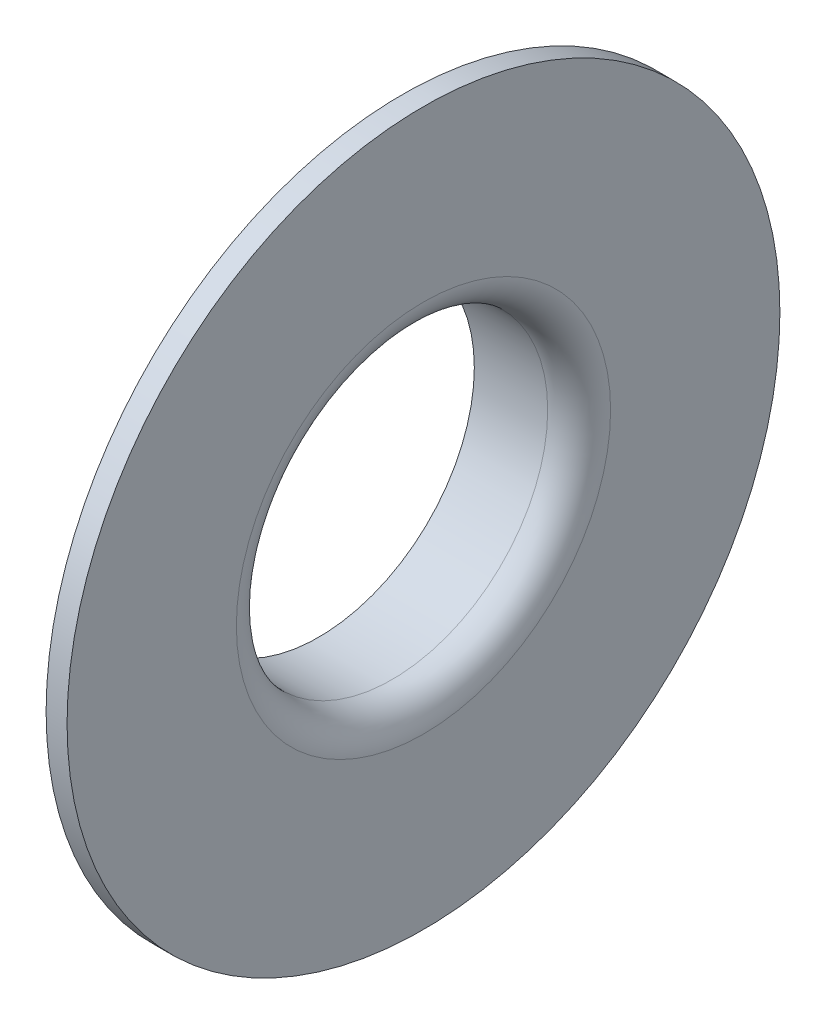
from build123d import *


with BuildPart() as part:
    # Esquisse1 → Base-R_vol.-Mince (revolve)
    with BuildSketch(Plane.XY, mode=Mode.PRIVATE) as base_r_vol_mince_sk:
        with BuildLine():
            Line((0, 16.85), (7, 16.85))
            ThreePointArc((7, 16.85), (7.707106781, 17.142893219), (8, 17.85))
            Line((8, 17.85), (8, 34))
            Line((8, 34), (10, 34))
            Line((10, 34), (10, 17.85))
            ThreePointArc((10, 17.85), (9.121320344, 15.728679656), (7, 14.85))
            Line((7, 14.85), (0, 14.85))
            Line((0, 14.85), (0, 16.85))
        make_face()
    revolve(base_r_vol_mince_sk.sketch.rotate(Axis((0, 0, 0), (1, 0, 0)), 90), axis=Axis((0, 0, 0), (1, 0, 0)))


solid = part.part
